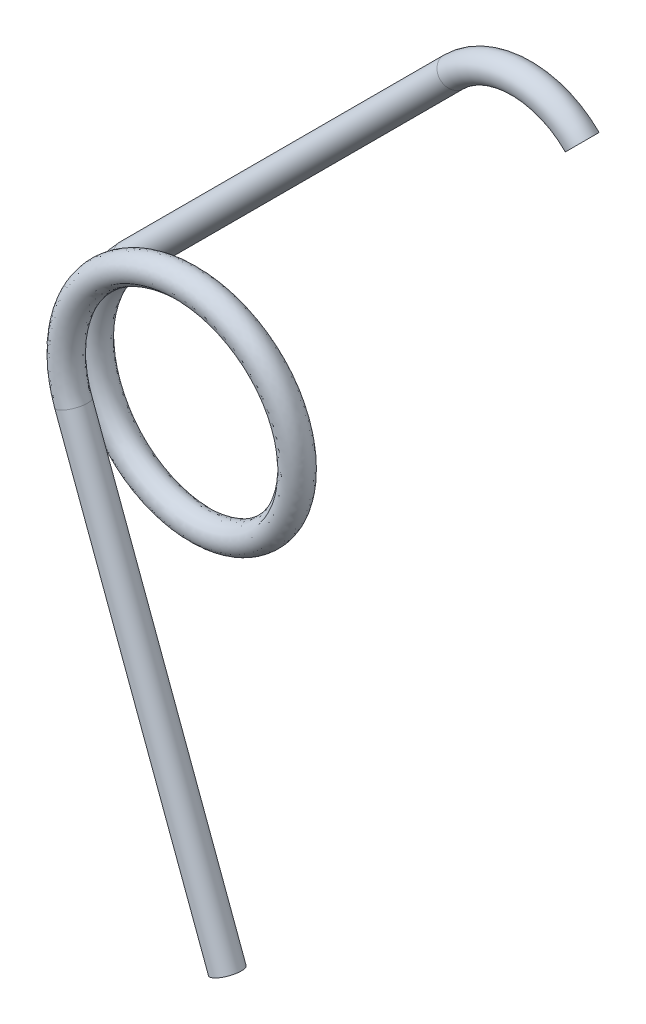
ISO-10303-21;
HEADER;
FILE_DESCRIPTION(('STEP AP214'),'2;1');
FILE_NAME('part.step','',(''),(''),'','','');
FILE_SCHEMA(('AUTOMOTIVE_DESIGN { 1 0 10303 214 1 1 1 1 }'));
ENDSEC;
DATA;
#1=APPLICATION_CONTEXT('core data for automotive mechanical design processes');
#2=APPLICATION_PROTOCOL_DEFINITION('international standard','automotive_design',2000,#1);
#3=PRODUCT_CONTEXT('',#1,'mechanical');
#4=PRODUCT('Part','Part','',(#3));
#5=PRODUCT_RELATED_PRODUCT_CATEGORY('part','',(#4));
#6=PRODUCT_DEFINITION_FORMATION('','',#4);
#7=PRODUCT_DEFINITION_CONTEXT('part definition',#1,'design');
#8=PRODUCT_DEFINITION('design','',#6,#7);
#9=PRODUCT_DEFINITION_SHAPE('','',#8);
#10=(LENGTH_UNIT() NAMED_UNIT(*) SI_UNIT(.MILLI.,.METRE.));
#11=(NAMED_UNIT(*) PLANE_ANGLE_UNIT() SI_UNIT($,.RADIAN.));
#12=(NAMED_UNIT(*) SI_UNIT($,.STERADIAN.) SOLID_ANGLE_UNIT());
#13=UNCERTAINTY_MEASURE_WITH_UNIT(LENGTH_MEASURE(1.E-05),#10,'distance_accuracy_value','');
#14=(GEOMETRIC_REPRESENTATION_CONTEXT(3) GLOBAL_UNCERTAINTY_ASSIGNED_CONTEXT((#13)) GLOBAL_UNIT_ASSIGNED_CONTEXT((#10,
#11,#12)) REPRESENTATION_CONTEXT('',''));
#15=CARTESIAN_POINT('',(0.,0.,0.));
#16=DIRECTION('',(0.,0.,1.));
#17=DIRECTION('',(1.,0.,0.));
#18=AXIS2_PLACEMENT_3D('',#15,#16,#17);
#19=CARTESIAN_POINT('',(-4.06776382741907,-1.76027859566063,1.571752));
#20=CARTESIAN_POINT('',(-4.79689509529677,-0.075355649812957,1.489202));
#21=CARTESIAN_POINT('',(-4.12104831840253,1.63163845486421,1.406652));
#22=CARTESIAN_POINT('',(-3.4452015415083,3.33863255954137,1.324102));
#23=CARTESIAN_POINT('',(-1.76027859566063,4.06776382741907,1.241552));
#24=CARTESIAN_POINT('',(-0.075355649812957,4.79689509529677,1.159002));
#25=CARTESIAN_POINT('',(1.63163845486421,4.12104831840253,1.076452));
#26=CARTESIAN_POINT('',(3.33863255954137,3.4452015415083,0.993902));
#27=CARTESIAN_POINT('',(4.06776382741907,1.76027859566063,0.911352));
#28=CARTESIAN_POINT('',(4.79689509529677,0.0753556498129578,0.828802));
#29=CARTESIAN_POINT('',(4.12104831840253,-1.63163845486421,0.746252));
#30=CARTESIAN_POINT('',(3.4452015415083,-3.33863255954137,0.663702));
#31=CARTESIAN_POINT('',(1.76027859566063,-4.06776382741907,0.581152));
#32=CARTESIAN_POINT('',(0.0753556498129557,-4.79689509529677,0.498602));
#33=CARTESIAN_POINT('',(-1.63163845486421,-4.12104831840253,0.416052));
#34=CARTESIAN_POINT('',(-3.33863255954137,-3.4452015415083,0.333502));
#35=CARTESIAN_POINT('',(-4.06776382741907,-1.76027859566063,0.250952));
#36=CARTESIAN_POINT('',(-4.79689509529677,-0.0753556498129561,0.168402));
#37=CARTESIAN_POINT('',(-4.12104831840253,1.63163845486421,0.0858520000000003));
#38=CARTESIAN_POINT('',(-3.78297808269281,2.48550640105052,0.0445590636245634));
#39=CARTESIAN_POINT('',(-3.13346779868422,3.13475084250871,-0.000130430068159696));
#40=CARTESIAN_POINT('',(-4.07054583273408,-1.75384976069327,1.74103455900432));
#41=CARTESIAN_POINT('',(-4.79701418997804,-0.0677744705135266,1.65848455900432));
#42=CARTESIAN_POINT('',(-4.11846962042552,1.6381515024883,1.57593455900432));
#43=CARTESIAN_POINT('',(-3.43992505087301,3.34407747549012,1.49338455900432));
#44=CARTESIAN_POINT('',(-1.75384976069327,4.07054583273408,1.41083455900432));
#45=CARTESIAN_POINT('',(-0.0677744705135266,4.79701418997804,1.32828455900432));
#46=CARTESIAN_POINT('',(1.6381515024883,4.11846962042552,1.24573455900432));
#47=CARTESIAN_POINT('',(3.34407747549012,3.43992505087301,1.16318455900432));
#48=CARTESIAN_POINT('',(4.07054583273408,1.75384976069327,1.08063455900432));
#49=CARTESIAN_POINT('',(4.79701418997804,0.0677744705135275,0.99808455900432));
#50=CARTESIAN_POINT('',(4.11846962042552,-1.6381515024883,0.915534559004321));
#51=CARTESIAN_POINT('',(3.43992505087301,-3.34407747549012,0.832984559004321));
#52=CARTESIAN_POINT('',(1.75384976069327,-4.07054583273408,0.750434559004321));
#53=CARTESIAN_POINT('',(0.0677744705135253,-4.79701418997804,0.667884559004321));
#54=CARTESIAN_POINT('',(-1.6381515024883,-4.11846962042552,0.585334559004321));
#55=CARTESIAN_POINT('',(-3.34407747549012,-3.43992505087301,0.502784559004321));
#56=CARTESIAN_POINT('',(-4.07054583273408,-1.75384976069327,0.420234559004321));
#57=CARTESIAN_POINT('',(-4.79701418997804,-0.0677744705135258,0.337684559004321));
#58=CARTESIAN_POINT('',(-4.11846962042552,1.6381515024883,0.255134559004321));
#59=CARTESIAN_POINT('',(-3.77904990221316,2.49148515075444,0.213841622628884));
#60=CARTESIAN_POINT('',(-3.12851352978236,3.13970308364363,0.169152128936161));
#61=CARTESIAN_POINT('',(-4.16784415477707,-1.77440829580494,2.21889817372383));
#62=CARTESIAN_POINT('',(-4.90282813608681,-0.0480307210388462,2.13634817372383));
#63=CARTESIAN_POINT('',(-4.20180700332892,1.69241472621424,2.05379817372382));
#64=CARTESIAN_POINT('',(-3.50078587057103,3.43286017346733,1.97124817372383));
#65=CARTESIAN_POINT('',(-1.77440829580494,4.16784415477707,1.88869817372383));
#66=CARTESIAN_POINT('',(-0.0480307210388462,4.90282813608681,1.80614817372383));
#67=CARTESIAN_POINT('',(1.69241472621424,4.20180700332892,1.72359817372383));
#68=CARTESIAN_POINT('',(3.43286017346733,3.50078587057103,1.64104817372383));
#69=CARTESIAN_POINT('',(4.16784415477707,1.77440829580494,1.55849817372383));
#70=CARTESIAN_POINT('',(4.90282813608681,0.048030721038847,1.47594817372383));
#71=CARTESIAN_POINT('',(4.20180700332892,-1.69241472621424,1.39339817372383));
#72=CARTESIAN_POINT('',(3.50078587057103,-3.43286017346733,1.31084817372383));
#73=CARTESIAN_POINT('',(1.77440829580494,-4.16784415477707,1.22829817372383));
#74=CARTESIAN_POINT('',(0.0480307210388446,-4.90282813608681,1.14574817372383));
#75=CARTESIAN_POINT('',(-1.69241472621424,-4.20180700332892,1.06319817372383));
#76=CARTESIAN_POINT('',(-3.43286017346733,-3.50078587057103,0.980648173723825));
#77=CARTESIAN_POINT('',(-4.16784415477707,-1.77440829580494,0.898098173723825));
#78=CARTESIAN_POINT('',(-4.90282813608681,-0.0480307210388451,0.815548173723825));
#79=CARTESIAN_POINT('',(-4.20180700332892,1.69241472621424,0.732998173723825));
#80=CARTESIAN_POINT('',(-3.85114411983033,2.56301561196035,0.691705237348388));
#81=CARTESIAN_POINT('',(-3.18342930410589,3.22261191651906,0.647015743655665));
#82=CARTESIAN_POINT('',(-5.1778133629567,-2.21146099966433,2.21889817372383));
#83=CARTESIAN_POINT('',(-6.09383050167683,-0.0667404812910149,2.13634817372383));
#84=CARTESIAN_POINT('',(-5.22500600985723,2.09752787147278,2.05379817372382));
#85=CARTESIAN_POINT('',(-4.35618151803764,4.26179622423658,1.97124817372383));
#86=CARTESIAN_POINT('',(-2.21146099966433,5.1778133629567,1.88869817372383));
#87=CARTESIAN_POINT('',(-0.0667404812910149,6.09383050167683,1.80614817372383));
#88=CARTESIAN_POINT('',(2.09752787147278,5.22500600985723,1.72359817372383));
#89=CARTESIAN_POINT('',(4.26179622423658,4.35618151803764,1.64104817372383));
#90=CARTESIAN_POINT('',(5.1778133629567,2.21146099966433,1.55849817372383));
#91=CARTESIAN_POINT('',(6.09383050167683,0.0667404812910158,1.47594817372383));
#92=CARTESIAN_POINT('',(5.22500600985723,-2.09752787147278,1.39339817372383));
#93=CARTESIAN_POINT('',(4.35618151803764,-4.26179622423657,1.31084817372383));
#94=CARTESIAN_POINT('',(2.21146099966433,-5.1778133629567,1.22829817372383));
#95=CARTESIAN_POINT('',(0.0667404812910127,-6.09383050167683,1.14574817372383));
#96=CARTESIAN_POINT('',(-2.09752787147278,-5.22500600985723,1.06319817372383));
#97=CARTESIAN_POINT('',(-4.26179622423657,-4.35618151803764,0.980648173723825));
#98=CARTESIAN_POINT('',(-5.1778133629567,-2.21146099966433,0.898098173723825));
#99=CARTESIAN_POINT('',(-6.09383050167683,-0.0667404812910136,0.815548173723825));
#100=CARTESIAN_POINT('',(-5.22500600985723,2.09752787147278,0.732998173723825));
#101=CARTESIAN_POINT('',(-4.79040498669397,3.18013229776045,0.691705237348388));
#102=CARTESIAN_POINT('',(-3.96142579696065,4.00092697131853,0.647015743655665));
#103=CARTESIAN_POINT('',(-5.2594051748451,-2.26831513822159,1.74103455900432));
#104=CARTESIAN_POINT('',(-6.19897206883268,-0.089798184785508,1.65848455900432));
#105=CARTESIAN_POINT('',(-5.32290208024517,2.115020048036,1.57593455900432));
#106=CARTESIAN_POINT('',(-4.44683209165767,4.31983828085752,1.49338455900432));
#107=CARTESIAN_POINT('',(-2.26831513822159,5.2594051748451,1.41083455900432));
#108=CARTESIAN_POINT('',(-0.089798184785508,6.19897206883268,1.32828455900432));
#109=CARTESIAN_POINT('',(2.115020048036,5.32290208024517,1.24573455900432));
#110=CARTESIAN_POINT('',(4.31983828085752,4.44683209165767,1.16318455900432));
#111=CARTESIAN_POINT('',(5.2594051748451,2.26831513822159,1.08063455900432));
#112=CARTESIAN_POINT('',(6.19897206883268,0.0897981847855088,0.99808455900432));
#113=CARTESIAN_POINT('',(5.32290208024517,-2.115020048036,0.915534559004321));
#114=CARTESIAN_POINT('',(4.44683209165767,-4.31983828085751,0.832984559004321));
#115=CARTESIAN_POINT('',(2.26831513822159,-5.2594051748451,0.750434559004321));
#116=CARTESIAN_POINT('',(0.0897981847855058,-6.19897206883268,0.667884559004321));
#117=CARTESIAN_POINT('',(-2.115020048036,-5.32290208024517,0.585334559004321));
#118=CARTESIAN_POINT('',(-4.31983828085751,-4.44683209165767,0.502784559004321));
#119=CARTESIAN_POINT('',(-5.2594051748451,-2.26831513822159,0.420234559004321));
#120=CARTESIAN_POINT('',(-6.19897206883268,-0.0897981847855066,0.337684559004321));
#121=CARTESIAN_POINT('',(-5.32290208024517,2.115020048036,0.255134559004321));
#122=CARTESIAN_POINT('',(-4.88467673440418,3.21790822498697,0.213841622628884));
#123=CARTESIAN_POINT('',(-4.0443121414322,4.05587668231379,0.169152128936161));
#124=CARTESIAN_POINT('',(-5.25384116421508,-2.28117280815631,1.40246944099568));
#125=CARTESIAN_POINT('',(-6.19873387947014,-0.104960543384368,1.31991944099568));
#126=CARTESIAN_POINT('',(-5.32805947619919,2.10199395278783,1.23736944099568));
#127=CARTESIAN_POINT('',(-4.45738507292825,4.30894844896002,1.15481944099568));
#128=CARTESIAN_POINT('',(-2.28117280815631,5.25384116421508,1.07226944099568));
#129=CARTESIAN_POINT('',(-0.104960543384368,6.19873387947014,0.98971944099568));
#130=CARTESIAN_POINT('',(2.10199395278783,5.32805947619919,0.90716944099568));
#131=CARTESIAN_POINT('',(4.30894844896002,4.45738507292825,0.82461944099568));
#132=CARTESIAN_POINT('',(5.25384116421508,2.28117280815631,0.74206944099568));
#133=CARTESIAN_POINT('',(6.19873387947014,0.104960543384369,0.65951944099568));
#134=CARTESIAN_POINT('',(5.32805947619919,-2.10199395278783,0.57696944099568));
#135=CARTESIAN_POINT('',(4.45738507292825,-4.30894844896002,0.49441944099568));
#136=CARTESIAN_POINT('',(2.28117280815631,-5.25384116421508,0.41186944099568));
#137=CARTESIAN_POINT('',(0.104960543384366,-6.19873387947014,0.32931944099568));
#138=CARTESIAN_POINT('',(-2.10199395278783,-5.32805947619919,0.24676944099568));
#139=CARTESIAN_POINT('',(-4.30894844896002,-4.45738507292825,0.16421944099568));
#140=CARTESIAN_POINT('',(-5.25384116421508,-2.28117280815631,0.08166944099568));
#141=CARTESIAN_POINT('',(-6.19873387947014,-0.104960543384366,-0.000880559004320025));
#142=CARTESIAN_POINT('',(-5.32805947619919,2.10199395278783,-0.0834305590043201));
#143=CARTESIAN_POINT('',(-4.89253309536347,3.20595072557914,-0.124723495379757));
#144=CARTESIAN_POINT('',(-4.05422067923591,4.04597220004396,-0.16941298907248));
#145=CARTESIAN_POINT('',(-5.15654284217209,-2.26061427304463,0.924605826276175));
#146=CARTESIAN_POINT('',(-6.09291993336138,-0.124704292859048,0.842055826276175));
#147=CARTESIAN_POINT('',(-5.2447220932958,2.04773072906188,0.759505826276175));
#148=CARTESIAN_POINT('',(-4.39652425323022,4.22016575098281,0.676955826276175));
#149=CARTESIAN_POINT('',(-2.26061427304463,5.15654284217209,0.594405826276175));
#150=CARTESIAN_POINT('',(-0.124704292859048,6.09291993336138,0.511855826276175));
#151=CARTESIAN_POINT('',(2.04773072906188,5.2447220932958,0.429305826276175));
#152=CARTESIAN_POINT('',(4.22016575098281,4.39652425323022,0.346755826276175));
#153=CARTESIAN_POINT('',(5.15654284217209,2.26061427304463,0.264205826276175));
#154=CARTESIAN_POINT('',(6.09291993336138,0.124704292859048,0.181655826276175));
#155=CARTESIAN_POINT('',(5.2447220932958,-2.04773072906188,0.0991058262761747));
#156=CARTESIAN_POINT('',(4.39652425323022,-4.22016575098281,0.0165558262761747));
#157=CARTESIAN_POINT('',(2.26061427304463,-5.15654284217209,-0.0659941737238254));
#158=CARTESIAN_POINT('',(0.124704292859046,-6.09291993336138,-0.148544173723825));
#159=CARTESIAN_POINT('',(-2.04773072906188,-5.2447220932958,-0.231094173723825));
#160=CARTESIAN_POINT('',(-4.22016575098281,-4.39652425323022,-0.313644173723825));
#161=CARTESIAN_POINT('',(-5.15654284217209,-2.26061427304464,-0.396194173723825));
#162=CARTESIAN_POINT('',(-6.09291993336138,-0.124704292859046,-0.478744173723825));
#163=CARTESIAN_POINT('',(-5.2447220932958,2.04773072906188,-0.561294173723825));
#164=CARTESIAN_POINT('',(-4.8204388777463,3.13442026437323,-0.602587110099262));
#165=CARTESIAN_POINT('',(-3.99930490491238,3.96306336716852,-0.647276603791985));
#166=CARTESIAN_POINT('',(-4.14657363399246,-1.82356156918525,0.924605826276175));
#167=CARTESIAN_POINT('',(-4.90191756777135,-0.105994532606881,0.842055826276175));
#168=CARTESIAN_POINT('',(-4.22152308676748,1.64261758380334,0.759505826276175));
#169=CARTESIAN_POINT('',(-3.54112860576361,3.39122970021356,0.676955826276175));
#170=CARTESIAN_POINT('',(-1.82356156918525,4.14657363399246,0.594405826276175));
#171=CARTESIAN_POINT('',(-0.105994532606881,4.90191756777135,0.511855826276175));
#172=CARTESIAN_POINT('',(1.64261758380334,4.22152308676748,0.429305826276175));
#173=CARTESIAN_POINT('',(3.39122970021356,3.54112860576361,0.346755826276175));
#174=CARTESIAN_POINT('',(4.14657363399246,1.82356156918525,0.264205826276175));
#175=CARTESIAN_POINT('',(4.90191756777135,0.105994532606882,0.181655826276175));
#176=CARTESIAN_POINT('',(4.22152308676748,-1.64261758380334,0.0991058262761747));
#177=CARTESIAN_POINT('',(3.54112860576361,-3.39122970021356,0.0165558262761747));
#178=CARTESIAN_POINT('',(1.82356156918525,-4.14657363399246,-0.0659941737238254));
#179=CARTESIAN_POINT('',(0.105994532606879,-4.90191756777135,-0.148544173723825));
#180=CARTESIAN_POINT('',(-1.64261758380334,-4.22152308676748,-0.231094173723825));
#181=CARTESIAN_POINT('',(-3.39122970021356,-3.54112860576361,-0.313644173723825));
#182=CARTESIAN_POINT('',(-4.14657363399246,-1.82356156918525,-0.396194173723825));
#183=CARTESIAN_POINT('',(-4.90191756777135,-0.10599453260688,-0.478744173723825));
#184=CARTESIAN_POINT('',(-4.22152308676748,1.64261758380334,-0.561294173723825));
#185=CARTESIAN_POINT('',(-3.88117801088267,2.51730357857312,-0.602587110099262));
#186=CARTESIAN_POINT('',(-3.22130841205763,3.18474831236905,-0.647276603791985));
#187=CARTESIAN_POINT('',(-4.06498182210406,-1.76670743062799,1.40246944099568));
#188=CARTESIAN_POINT('',(-4.7967760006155,-0.0829368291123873,1.31991944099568));
#189=CARTESIAN_POINT('',(-4.12362701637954,1.62512540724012,1.23736944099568));
#190=CARTESIAN_POINT('',(-3.45047803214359,3.33318764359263,1.15481944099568));
#191=CARTESIAN_POINT('',(-1.76670743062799,4.06498182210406,1.07226944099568));
#192=CARTESIAN_POINT('',(-0.0829368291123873,4.7967760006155,0.98971944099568));
#193=CARTESIAN_POINT('',(1.62512540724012,4.12362701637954,0.90716944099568));
#194=CARTESIAN_POINT('',(3.33318764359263,3.45047803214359,0.82461944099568));
#195=CARTESIAN_POINT('',(4.06498182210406,1.76670743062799,0.74206944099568));
#196=CARTESIAN_POINT('',(4.7967760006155,0.0829368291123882,0.65951944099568));
#197=CARTESIAN_POINT('',(4.12362701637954,-1.62512540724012,0.57696944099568));
#198=CARTESIAN_POINT('',(3.45047803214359,-3.33318764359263,0.49441944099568));
#199=CARTESIAN_POINT('',(1.76670743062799,-4.06498182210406,0.41186944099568));
#200=CARTESIAN_POINT('',(0.082936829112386,-4.7967760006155,0.32931944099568));
#201=CARTESIAN_POINT('',(-1.62512540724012,-4.12362701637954,0.24676944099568));
#202=CARTESIAN_POINT('',(-3.33318764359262,-3.45047803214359,0.16421944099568));
#203=CARTESIAN_POINT('',(-4.06498182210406,-1.76670743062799,0.08166944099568));
#204=CARTESIAN_POINT('',(-4.7967760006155,-0.0829368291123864,-0.000880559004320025));
#205=CARTESIAN_POINT('',(-4.12362701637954,1.62512540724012,-0.0834305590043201));
#206=CARTESIAN_POINT('',(-3.78690626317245,2.47952765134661,-0.124723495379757));
#207=CARTESIAN_POINT('',(-3.13842206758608,3.12979860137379,-0.16941298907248));
#208=CARTESIAN_POINT('',(-4.06776382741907,-1.76027859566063,1.571752));
#209=CARTESIAN_POINT('',(-4.79689509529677,-0.075355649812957,1.489202));
#210=CARTESIAN_POINT('',(-4.12104831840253,1.63163845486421,1.406652));
#211=CARTESIAN_POINT('',(-3.4452015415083,3.33863255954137,1.324102));
#212=CARTESIAN_POINT('',(-1.76027859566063,4.06776382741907,1.241552));
#213=CARTESIAN_POINT('',(-0.075355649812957,4.79689509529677,1.159002));
#214=CARTESIAN_POINT('',(1.63163845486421,4.12104831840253,1.076452));
#215=CARTESIAN_POINT('',(3.33863255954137,3.4452015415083,0.993902));
#216=CARTESIAN_POINT('',(4.06776382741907,1.76027859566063,0.911352));
#217=CARTESIAN_POINT('',(4.79689509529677,0.0753556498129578,0.828802));
#218=CARTESIAN_POINT('',(4.12104831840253,-1.63163845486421,0.746252));
#219=CARTESIAN_POINT('',(3.4452015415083,-3.33863255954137,0.663702));
#220=CARTESIAN_POINT('',(1.76027859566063,-4.06776382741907,0.581152));
#221=CARTESIAN_POINT('',(0.0753556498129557,-4.79689509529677,0.498602));
#222=CARTESIAN_POINT('',(-1.63163845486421,-4.12104831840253,0.416052));
#223=CARTESIAN_POINT('',(-3.33863255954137,-3.4452015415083,0.333502));
#224=CARTESIAN_POINT('',(-4.06776382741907,-1.76027859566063,0.250952));
#225=CARTESIAN_POINT('',(-4.79689509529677,-0.0753556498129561,0.168402));
#226=CARTESIAN_POINT('',(-4.12104831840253,1.63163845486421,0.0858520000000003));
#227=CARTESIAN_POINT('',(-3.78297808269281,2.48550640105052,0.0445590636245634));
#228=CARTESIAN_POINT('',(-3.13346779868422,3.13475084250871,-0.000130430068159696));
#229=(BOUNDED_SURFACE() B_SPLINE_SURFACE(3,2,((#19,#20,#21,#22,#23,#24,#25,#26,#27,#28,#29,#30,
#31,#32,#33,#34,#35,#36,#37,#38,#39),(#40,#41,#42,#43,#44,#45,#46,#47,#48,#49,#50,#51,#52,#53,
#54,#55,#56,#57,#58,#59,#60),(#61,#62,#63,#64,#65,#66,#67,#68,#69,#70,#71,#72,#73,#74,#75,#76,
#77,#78,#79,#80,#81),(#82,#83,#84,#85,#86,#87,#88,#89,#90,#91,#92,#93,#94,#95,#96,#97,#98,#99,
#100,#101,#102),(#103,#104,#105,#106,#107,#108,#109,#110,#111,#112,#113,#114,#115,#116,#117,
#118,#119,#120,#121,#122,#123),(#124,#125,#126,#127,#128,#129,#130,#131,#132,#133,#134,#135,
#136,#137,#138,#139,#140,#141,#142,#143,#144),(#145,#146,#147,#148,#149,#150,#151,#152,#153,
#154,#155,#156,#157,#158,#159,#160,#161,#162,#163,#164,#165),(#166,#167,#168,#169,#170,#171,
#172,#173,#174,#175,#176,#177,#178,#179,#180,#181,#182,#183,#184,#185,#186),(#187,#188,#189,
#190,#191,#192,#193,#194,#195,#196,#197,#198,#199,#200,#201,#202,#203,#204,#205,#206,#207),
(#208,#209,#210,#211,#212,#213,#214,#215,#216,#217,#218,#219,#220,#221,#222,#223,#224,#225,#226,
#227,#228)),.UNSPECIFIED.,.T.,.F.,.F.) B_SPLINE_SURFACE_WITH_KNOTS((4,2,2,2,4),(3,2,2,2,2,2,2,2,
2,2,3),(0.,0.25,0.5,0.75,1.),(0.,0.0625,0.125,0.1875,0.25,0.3125,0.375,0.4375,0.5,0.5625,0.595),
.UNSPECIFIED.) GEOMETRIC_REPRESENTATION_ITEM() RATIONAL_B_SPLINE_SURFACE(((1.,0.923879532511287,
1.,0.923879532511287,1.,0.923879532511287,1.,0.923879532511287,1.,0.923879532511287,1.,
0.923879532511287,1.,0.923879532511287,1.,0.923879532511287,1.,0.923879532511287,1.,
0.960417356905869,0.962000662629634),(1.,0.923879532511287,1.,0.923879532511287,1.,
0.923879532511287,1.,0.923879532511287,1.,0.923879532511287,1.,0.923879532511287,1.,
0.923879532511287,1.,0.923879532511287,1.,0.923879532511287,1.,0.960417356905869,
0.962000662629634),(0.68211091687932,0.630188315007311,0.68211091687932,0.630188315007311,
0.68211091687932,0.630188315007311,0.68211091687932,0.630188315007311,0.68211091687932,
0.630188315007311,0.68211091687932,0.630188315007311,0.68211091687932,0.630188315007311,
0.68211091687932,0.630188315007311,0.68211091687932,0.630188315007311,0.68211091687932,
0.655111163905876,0.656191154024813),(0.68211091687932,0.630188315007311,0.68211091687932,
0.630188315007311,0.68211091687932,0.630188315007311,0.68211091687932,0.630188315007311,
0.68211091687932,0.630188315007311,0.68211091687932,0.630188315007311,0.68211091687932,
0.630188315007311,0.68211091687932,0.630188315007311,0.68211091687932,0.630188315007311,
0.68211091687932,0.655111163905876,0.656191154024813),(1.,0.923879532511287,1.,
0.923879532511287,1.,0.923879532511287,1.,0.923879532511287,1.,0.923879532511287,1.,
0.923879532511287,1.,0.923879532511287,1.,0.923879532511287,1.,0.923879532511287,1.,
0.960417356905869,0.962000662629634),(1.,0.923879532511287,1.,0.923879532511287,1.,
0.923879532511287,1.,0.923879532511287,1.,0.923879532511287,1.,0.923879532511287,1.,
0.923879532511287,1.,0.923879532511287,1.,0.923879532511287,1.,0.960417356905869,
0.962000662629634),(0.68211091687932,0.630188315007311,0.68211091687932,0.630188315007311,
0.68211091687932,0.630188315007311,0.68211091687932,0.630188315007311,0.68211091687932,
0.630188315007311,0.68211091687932,0.630188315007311,0.68211091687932,0.630188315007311,
0.68211091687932,0.630188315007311,0.68211091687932,0.630188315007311,0.68211091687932,
0.655111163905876,0.656191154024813),(0.68211091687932,0.630188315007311,0.68211091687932,
0.630188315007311,0.68211091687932,0.630188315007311,0.68211091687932,0.630188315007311,
0.68211091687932,0.630188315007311,0.68211091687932,0.630188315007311,0.68211091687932,
0.630188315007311,0.68211091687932,0.630188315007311,0.68211091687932,0.630188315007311,
0.68211091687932,0.655111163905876,0.656191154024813),(1.,0.923879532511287,1.,
0.923879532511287,1.,0.923879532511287,1.,0.923879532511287,1.,0.923879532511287,1.,
0.923879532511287,1.,0.923879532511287,1.,0.923879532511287,1.,0.923879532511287,1.,
0.960417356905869,0.962000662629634),(1.,0.923879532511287,1.,0.923879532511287,1.,
0.923879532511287,1.,0.923879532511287,1.,0.923879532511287,1.,0.923879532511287,1.,
0.923879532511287,1.,0.923879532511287,1.,0.923879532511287,1.,0.960417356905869,0.962000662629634))) REPRESENTATION_ITEM('') SURFACE());
#230=CARTESIAN_POINT('',(-4.06776382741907,-1.76027859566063,1.571752));
#231=CARTESIAN_POINT('',(-4.06498182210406,-1.76670743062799,1.40246944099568));
#232=CARTESIAN_POINT('',(-4.14657363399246,-1.82356156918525,0.924605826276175));
#233=CARTESIAN_POINT('',(-5.15654284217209,-2.26061427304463,0.924605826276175));
#234=CARTESIAN_POINT('',(-5.25384116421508,-2.28117280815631,1.40246944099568));
#235=CARTESIAN_POINT('',(-5.2594051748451,-2.26831513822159,1.74103455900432));
#236=CARTESIAN_POINT('',(-5.1778133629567,-2.21146099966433,2.21889817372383));
#237=CARTESIAN_POINT('',(-4.16784415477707,-1.77440829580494,2.21889817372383));
#238=CARTESIAN_POINT('',(-4.07054583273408,-1.75384976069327,1.74103455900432));
#239=CARTESIAN_POINT('',(-4.06776382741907,-1.76027859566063,1.571752));
#240=(BOUNDED_CURVE() B_SPLINE_CURVE(3,(#230,#231,#232,#233,#234,#235,#236,#237,#238,#239),
.UNSPECIFIED.,.T.,.F.) B_SPLINE_CURVE_WITH_KNOTS((4,2,2,2,4),(0.,0.25,0.5,0.75,1.),
.UNSPECIFIED.) CURVE() GEOMETRIC_REPRESENTATION_ITEM() RATIONAL_B_SPLINE_CURVE((1.,1.,
0.68211091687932,0.68211091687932,1.,1.,0.68211091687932,0.68211091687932,1.,1.)) REPRESENTATION_ITEM(''));
#241=CARTESIAN_POINT('',(-4.06776382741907,-1.76027859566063,1.571752));
#242=VERTEX_POINT('',#241);
#243=CARTESIAN_POINT('',(-5.25662317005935,-2.2747439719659,1.57175203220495));
#244=VERTEX_POINT('',#243);
#245=EDGE_CURVE('E43',#242,#244,#240,.F.);
#246=CARTESIAN_POINT('',(-4.06776382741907,-1.76027859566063,1.571752));
#247=CARTESIAN_POINT('',(-4.06498182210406,-1.76670743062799,1.40246944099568));
#248=CARTESIAN_POINT('',(-4.14657363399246,-1.82356156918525,0.924605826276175));
#249=CARTESIAN_POINT('',(-5.15654284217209,-2.26061427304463,0.924605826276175));
#250=CARTESIAN_POINT('',(-5.25384116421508,-2.28117280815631,1.40246944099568));
#251=CARTESIAN_POINT('',(-5.2594051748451,-2.26831513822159,1.74103455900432));
#252=CARTESIAN_POINT('',(-5.1778133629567,-2.21146099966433,2.21889817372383));
#253=CARTESIAN_POINT('',(-4.16784415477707,-1.77440829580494,2.21889817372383));
#254=CARTESIAN_POINT('',(-4.07054583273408,-1.75384976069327,1.74103455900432));
#255=CARTESIAN_POINT('',(-4.06776382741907,-1.76027859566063,1.571752));
#256=(BOUNDED_CURVE() B_SPLINE_CURVE(3,(#246,#247,#248,#249,#250,#251,#252,#253,#254,#255),
.UNSPECIFIED.,.T.,.F.) B_SPLINE_CURVE_WITH_KNOTS((4,2,2,2,4),(0.,0.25,0.5,0.75,1.),
.UNSPECIFIED.) CURVE() GEOMETRIC_REPRESENTATION_ITEM() RATIONAL_B_SPLINE_CURVE((1.,1.,
0.68211091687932,0.68211091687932,1.,1.,0.68211091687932,0.68211091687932,1.,1.)) REPRESENTATION_ITEM(''));
#257=EDGE_CURVE('E51',#244,#242,#256,.F.);
#258=CARTESIAN_POINT('',(-3.13346779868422,3.13475084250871,-0.000130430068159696));
#259=CARTESIAN_POINT('',(-3.12851352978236,3.13970308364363,0.169152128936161));
#260=CARTESIAN_POINT('',(-3.18342930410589,3.22261191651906,0.647015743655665));
#261=CARTESIAN_POINT('',(-3.96142579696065,4.00092697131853,0.647015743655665));
#262=CARTESIAN_POINT('',(-4.0443121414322,4.05587668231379,0.169152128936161));
#263=CARTESIAN_POINT('',(-4.05422067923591,4.04597220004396,-0.16941298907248));
#264=CARTESIAN_POINT('',(-3.99930490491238,3.96306336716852,-0.647276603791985));
#265=CARTESIAN_POINT('',(-3.22130841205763,3.18474831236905,-0.647276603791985));
#266=CARTESIAN_POINT('',(-3.13842206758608,3.12979860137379,-0.16941298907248));
#267=CARTESIAN_POINT('',(-3.13346779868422,3.13475084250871,-0.000130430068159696));
#268=(BOUNDED_CURVE() B_SPLINE_CURVE(3,(#258,#259,#260,#261,#262,#263,#264,#265,#266,#267),
.UNSPECIFIED.,.T.,.F.) B_SPLINE_CURVE_WITH_KNOTS((4,2,2,2,4),(0.,0.25,0.5,0.75,1.),
.UNSPECIFIED.) CURVE() GEOMETRIC_REPRESENTATION_ITEM() RATIONAL_B_SPLINE_CURVE((0.962000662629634,
0.962000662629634,0.656191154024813,0.656191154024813,0.962000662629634,0.962000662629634,
0.656191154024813,0.656191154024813,0.962000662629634,0.962000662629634)) REPRESENTATION_ITEM(''));
#269=CARTESIAN_POINT('',(-3.13346779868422,3.13475084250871,-0.000130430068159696));
#270=VERTEX_POINT('',#269);
#271=EDGE_CURVE('E11',#270,#270,#268,.F.);
#272=ORIENTED_EDGE('',*,*,#245,.F.);
#273=ORIENTED_EDGE('',*,*,#257,.F.);
#274=EDGE_LOOP('',(#272,#273));
#275=FACE_BOUND('',#274,.T.);
#276=ORIENTED_EDGE('',*,*,#271,.F.);
#277=EDGE_LOOP('',(#276));
#278=FACE_BOUND('',#277,.T.);
#279=ADVANCED_FACE('F32',(#275,#278),#229,.F.);
#280=CARTESIAN_POINT('',(3.40095121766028,-20.6503393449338,2.41188041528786));
#281=DIRECTION('',(-0.396808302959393,0.91696988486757,-0.0413449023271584));
#282=DIRECTION('',(-0.917754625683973,-0.397147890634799,0.));
#283=AXIS2_PLACEMENT_3D('',#280,#281,#282);
#284=CYLINDRICAL_SURFACE('',#283,0.647700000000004);
#285=CARTESIAN_POINT('',(3.40095121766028,-20.6503393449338,2.41188041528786));
#286=DIRECTION('',(0.396808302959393,-0.91696988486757,0.0413449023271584));
#287=DIRECTION('',(0.917754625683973,0.397147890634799,0.));
#288=AXIS2_PLACEMENT_3D('',#285,#286,#287);
#289=CIRCLE('',#288,0.647700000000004);
#290=CARTESIAN_POINT('',(3.99538088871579,-20.3931066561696,2.41188041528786));
#291=VERTEX_POINT('',#290);
#292=EDGE_CURVE('E56',#291,#291,#289,.T.);
#293=ORIENTED_EDGE('',*,*,#292,.F.);
#294=EDGE_LOOP('',(#293));
#295=FACE_BOUND('',#294,.T.);
#296=ORIENTED_EDGE('',*,*,#245,.T.);
#297=ORIENTED_EDGE('',*,*,#257,.T.);
#298=EDGE_LOOP('',(#296,#297));
#299=FACE_BOUND('',#298,.T.);
#300=ADVANCED_FACE('F60',(#295,#299),#284,.T.);
#301=CARTESIAN_POINT('',(3.40095121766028,-20.6503393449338,2.41188041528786));
#302=DIRECTION('',(0.396808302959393,-0.91696988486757,0.0413449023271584));
#303=DIRECTION('',(0.917754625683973,0.397147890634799,0.));
#304=AXIS2_PLACEMENT_3D('',#301,#302,#303);
#305=PLANE('',#304);
#306=ORIENTED_EDGE('',*,*,#292,.T.);
#307=EDGE_LOOP('',(#306));
#308=FACE_BOUND('',#307,.T.);
#309=ADVANCED_FACE('F73',(#308),#305,.T.);
#310=CARTESIAN_POINT('',(10.7676912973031,17.9460187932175,-0.840257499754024));
#311=DIRECTION('',(-0.706646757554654,-0.706357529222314,0.0413449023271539));
#312=DIRECTION('',(0.706962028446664,-0.707251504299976,0.));
#313=AXIS2_PLACEMENT_3D('',#310,#311,#312);
#314=CYLINDRICAL_SURFACE('',#313,0.647699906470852);
#315=CARTESIAN_POINT('',(10.7676912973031,17.9460187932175,-0.840257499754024));
#316=DIRECTION('',(0.706646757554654,0.706357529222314,-0.0413449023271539));
#317=DIRECTION('',(-0.706962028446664,0.707251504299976,0.));
#318=AXIS2_PLACEMENT_3D('',#315,#316,#317);
#319=CIRCLE('',#318,0.647699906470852);
#320=CARTESIAN_POINT('',(10.3097915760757,18.4041050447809,-0.840273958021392));
#321=VERTEX_POINT('',#320);
#322=EDGE_CURVE('E38',#321,#321,#319,.T.);
#323=ORIENTED_EDGE('',*,*,#322,.F.);
#324=EDGE_LOOP('',(#323));
#325=FACE_BOUND('',#324,.T.);
#326=ORIENTED_EDGE('',*,*,#271,.T.);
#327=EDGE_LOOP('',(#326));
#328=FACE_BOUND('',#327,.T.);
#329=ADVANCED_FACE('F89',(#325,#328),#314,.T.);
#330=CARTESIAN_POINT('',(13.7037880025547,15.0087260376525,-0.840151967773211));
#331=DIRECTION('',(0.029223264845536,0.0292472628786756,0.999144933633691));
#332=DIRECTION('',(0.,-0.999571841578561,0.0292597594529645));
#333=AXIS2_PLACEMENT_3D('',#330,#331,#332);
#334=TOROIDAL_SURFACE('',#333,4.15311360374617,0.647699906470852);
#335=CARTESIAN_POINT('',(16.6391626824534,17.9417183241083,-1.01186201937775));
#336=DIRECTION('',(0.706820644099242,-0.707392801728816,3.37251871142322E-05));
#337=DIRECTION('',(0.706789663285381,0.706216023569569,-0.0413194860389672));
#338=AXIS2_PLACEMENT_3D('',#335,#336,#337);
#339=CIRCLE('',#338,0.647699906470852);
#340=CARTESIAN_POINT('',(17.09694980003,18.3991338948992,-1.03864110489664));
#341=VERTEX_POINT('',#340);
#342=EDGE_CURVE('E150',#341,#341,#339,.T.);
#343=CARTESIAN_POINT('',(13.7037880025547,15.0087260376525,-0.840151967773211));
#344=DIRECTION('',(0.029223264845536,0.0292472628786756,0.999144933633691));
#345=DIRECTION('',(0.,-0.999571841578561,0.0292597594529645));
#346=AXIS2_PLACEMENT_3D('',#343,#344,#345);
#347=CIRCLE('',#346,4.80081351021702);
#348=EDGE_CURVE('',#341,#321,#347,.T.);
#349=ORIENTED_EDGE('',*,*,#342,.F.);
#350=ORIENTED_EDGE('',*,*,#322,.T.);
#351=ORIENTED_EDGE('',*,*,#348,.T.);
#352=ORIENTED_EDGE('',*,*,#348,.F.);
#353=EDGE_LOOP('',(#349,#351,#350,#352));
#354=FACE_BOUND('',#353,.T.);
#355=ADVANCED_FACE('F98',(#354),#334,.T.);
#356=CARTESIAN_POINT('',(16.6391626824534,17.9417183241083,-1.01186201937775));
#357=DIRECTION('',(0.706820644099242,-0.707392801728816,3.37251871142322E-05));
#358=DIRECTION('',(0.706789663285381,0.706216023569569,-0.0413194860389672));
#359=AXIS2_PLACEMENT_3D('',#356,#357,#358);
#360=PLANE('',#359);
#361=ORIENTED_EDGE('',*,*,#342,.T.);
#362=EDGE_LOOP('',(#361));
#363=FACE_BOUND('',#362,.T.);
#364=ADVANCED_FACE('F100',(#363),#360,.T.);
#365=CLOSED_SHELL('',(#279,#300,#309,#329,#355,#364));
#366=MANIFOLD_SOLID_BREP('B2',#365);
#367=ADVANCED_BREP_SHAPE_REPRESENTATION('',(#18,#366),#14);
#368=SHAPE_DEFINITION_REPRESENTATION(#9,#367);
ENDSEC;
END-ISO-10303-21;
